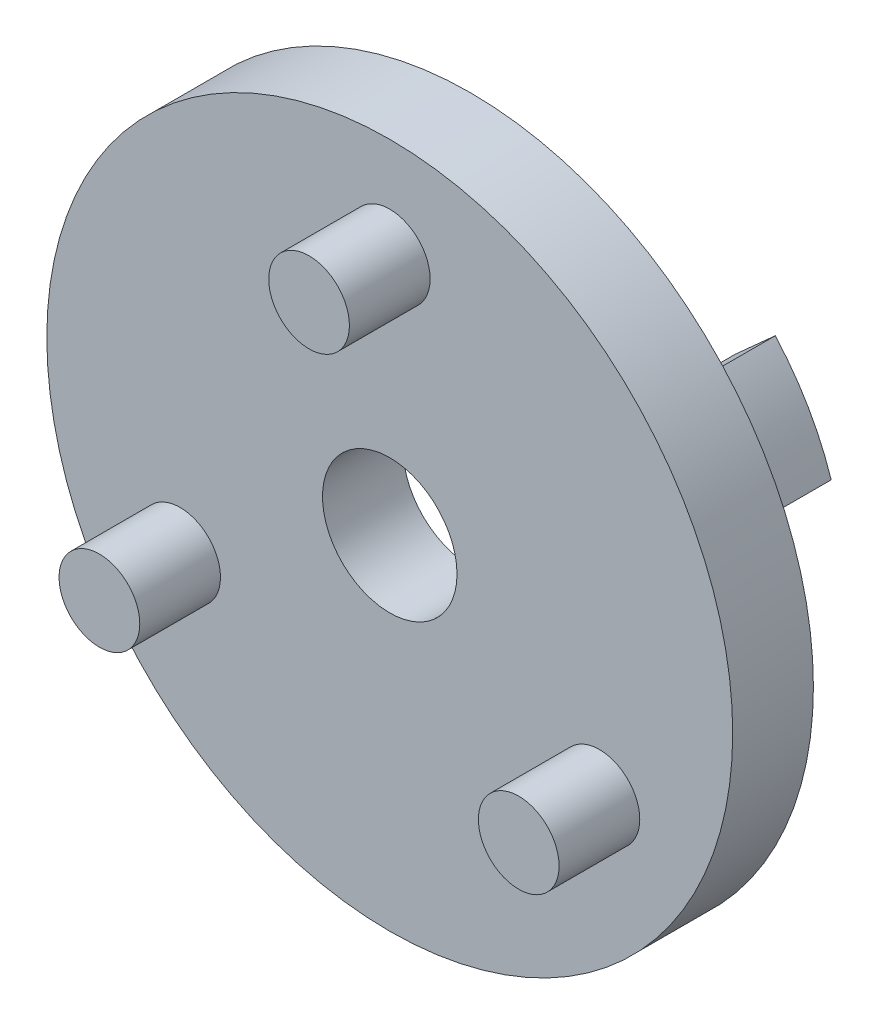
from build123d import *

# Parameters (mm, degrees)
ESQUISSE1_R      = 12.75
ESQUISSE1_R_2    = 2.5
EXTRUSION1_DEPTH = 3
ESQUISSE2_R      = 1.5
EXTRUSION2_DEPTH = 3
EXTRUSION3_DEPTH = 3.9


with BuildPart() as part:
    # Esquisse1 → Extrusion1 (new body)
    with BuildSketch(Plane.XY):
        Circle(ESQUISSE1_R)
        Circle(ESQUISSE1_R_2, mode=Mode.SUBTRACT)
    extrude(amount=EXTRUSION1_DEPTH)

    # Esquisse2 → Extrusion2 (add)
    with BuildSketch(Plane.XY.offset(3)):
        with Locations((0, 9)):
            Circle(ESQUISSE2_R)
        with Locations((7.794228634, -4.5)):
            Circle(ESQUISSE2_R)
        with Locations((-7.794228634, -4.5)):
            Circle(ESQUISSE2_R)
    extrude(amount=EXTRUSION2_DEPTH)

    # Esquisse3 → Extrusion3 (add)
    with BuildSketch(Plane(origin=(0, 0, 0), x_dir=(-1, 0, 0), z_dir=(0, 0, -1))):
        with BuildLine():
            Line((-7.60845213, 2.472135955), (-9.510565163, 3.090169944))
            ThreePointArc((-9.510565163, 3.090169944), (-8.660254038, 5), (-7.431448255, 6.691306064))
            Line((-7.431448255, 6.691306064), (-5.945158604, 5.353044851))
            ThreePointArc((-5.945158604, 5.353044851), (-6.92820323, 4), (-7.60845213, 2.472135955))
        make_face()
        with BuildLine():
            Line((7.589647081, 2.477174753), (9.491760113, 3.095208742))
            ThreePointArc((9.491760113, 3.095208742), (8.641448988, 5.005038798), (7.412643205, 6.696344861))
            Line((7.412643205, 6.696344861), (5.926353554, 5.358083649))
            ThreePointArc((5.926353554, 5.358083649), (6.909398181, 4.005038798), (7.589647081, 2.477174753))
        make_face()
        with BuildLine():
            Line((-1.668332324, -7.806375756), (-2.084155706, -9.762670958))
            ThreePointArc((-2.084155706, -9.762670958), (-0.005038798, -9.981194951), (2.07407811, -9.762670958))
            Line((2.07407811, -9.762670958), (1.658254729, -7.806375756))
            ThreePointArc((1.658254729, -7.806375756), (-0.005038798, -7.981194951), (-1.668332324, -7.806375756))
        make_face()
    extrude(amount=EXTRUSION3_DEPTH)


solid = part.part
